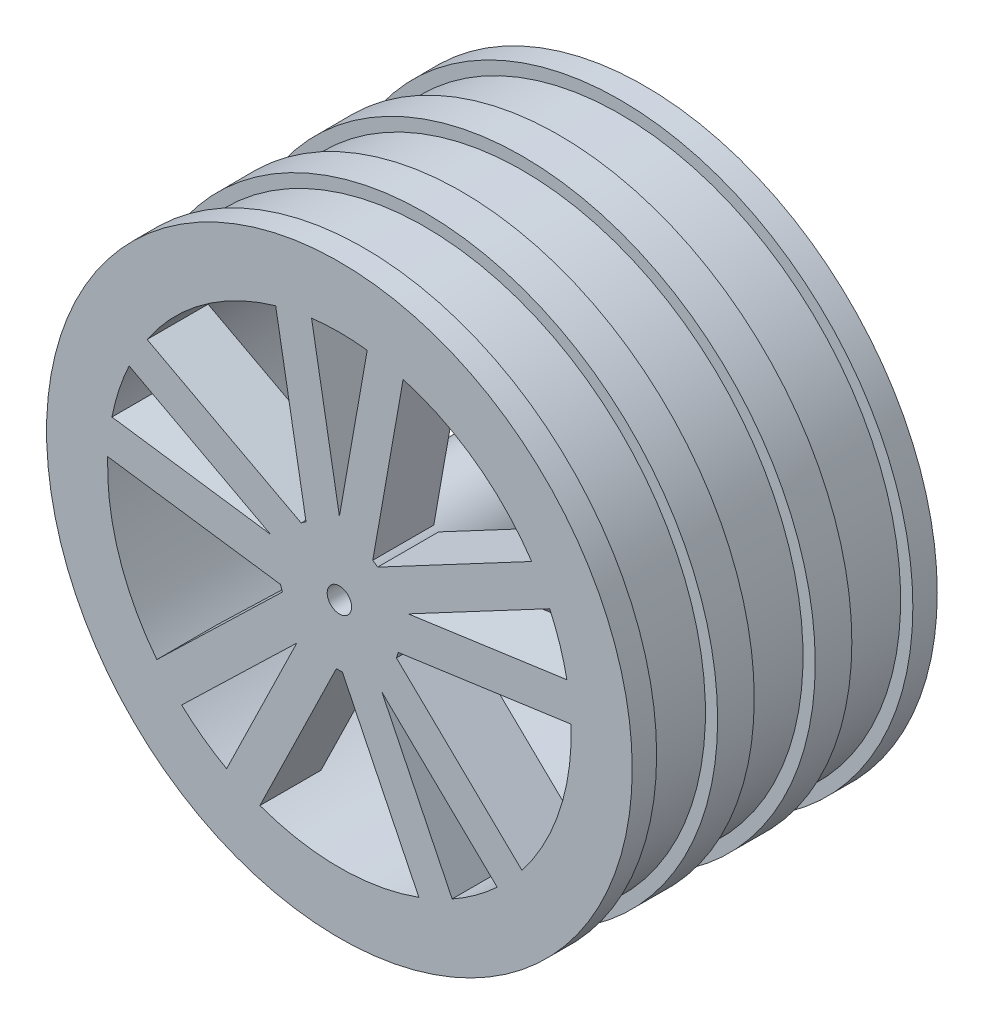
from build123d import *
from build123d.topology import SkipClean

# Parameters (mm, degrees)
SKETCH2_W            = 25
SKETCH2_H            = 5
BOSS_EXTRUDE1_DEPTH  = 5
CIRPATTERN1_COUNT    = 5
MIRROR1_COPY_1_DEPTH = 5
MIRROR1_COPY_2_DEPTH = 5
MIRROR1_COPY_3_DEPTH = 5
MIRROR1_COPY_4_DEPTH = 5
SKETCH4_R            = 5
BOSS_EXTRUDE2_DEPTH  = 25
SKETCH5_R            = 1
CUT_EXTRUDE1_DEPTH   = 43.154478
SKETCH6_W            = 5
SKETCH6_H            = 2


with BuildPart() as part:
    # Sketch2 → Revolve1 (revolve)
    with BuildSketch(Plane(origin=(0, 0, 0), x_dir=(0, 0, -1), z_dir=(1, 0, 0)), mode=Mode.PRIVATE) as revolve1_sk:
        with Locations((0, 21.5)):
            Rectangle(SKETCH2_W, SKETCH2_H)
    revolve(revolve1_sk.sketch.rotate(Axis((0, 0, 29.66813), (0, 0, -1)), 90), axis=Axis((0, 0, 29.66813), (0, 0, -1)))

    # Sketch3 → Boss-Extrude1 (add)
    with BuildSketch(Plane.XY.offset(12.5)):
        with BuildLine():
            Line((-6.093191, 23.213639), (-2, 0))
            Line((-2, 0), (0, 0))
            Line((0, 0), (0, 5.933748))
            Line((0, 5.933748), (-2.627489, 20.834978))
            ThreePointArc((-2.627489, 20.834978), (-1.316333, 20.958704), (0, 21))
            Line((0, 21), (0, 24))
            ThreePointArc((0, 24), (-3.071862, 23.802598), (-6.093191, 23.213639))
        make_face()
        with BuildLine():
            Line((0, 5.933748), (0, 0))
            Line((0, 0), (2, 0))
            Line((2, 0), (6.093191, 23.213639))
            ThreePointArc((6.093191, 23.213639), (3.071862, 23.802598), (0, 24))
            Line((0, 24), (0, 21))
            ThreePointArc((0, 21), (1.316333, 20.958704), (2.627489, 20.834978))
            Line((2.627489, 20.834978), (0, 5.933748))
        make_face()
    boss_extrude1 = extrude(amount=-BOSS_EXTRUDE1_DEPTH)

    # CirPattern1: Boss-Extrude1 ×5 about axis
    with SkipClean():  # the faces are left unmerged after this step: merging them gives an invalid solid
        cirpattern1_axis = Axis((0, 0, 0), (0, 0, 1))
        for i in range(1, CIRPATTERN1_COUNT):
            add(boss_extrude1.rotate(cirpattern1_axis, i * 360 / CIRPATTERN1_COUNT))

    # Mirror1: Boss-Extrude1 across plane
    with SkipClean():  # the faces are left unmerged after this step: merging them gives an invalid solid
        add(boss_extrude1.mirror(Plane.XY))

    # Mirror1 copy 1 sketch → Mirror1 copy 1 (add)
    with SkipClean():  # the faces are left unmerged after this step: merging them gives an invalid solid
        with BuildSketch(Plane(origin=(0, 0, -12.5), x_dir=(0.30901699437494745, 0.9510565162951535, 0), z_dir=(0, 0, -1))):
            with BuildLine():
                Line((-6.093191, -23.213639), (-2, 0))
                Line((-2, 0), (0, 0))
                Line((0, 0), (0, -5.933748))
                Line((0, -5.933748), (-2.627489, -20.834978))
                ThreePointArc((-2.627489, -20.834978), (-1.316333, -20.958704), (0, -21))
                Line((0, -21), (0, -24))
                ThreePointArc((0, -24), (-3.071862, -23.802598), (-6.093191, -23.213639))
            make_face()
            with BuildLine():
                Line((0, -5.933748), (0, 0))
                Line((0, 0), (2, 0))
                Line((2, 0), (6.093191, -23.213639))
                ThreePointArc((6.093191, -23.213639), (3.071862, -23.802598), (0, -24))
                Line((0, -24), (0, -21))
                ThreePointArc((0, -21), (1.316333, -20.958704), (2.627489, -20.834978))
                Line((2.627489, -20.834978), (0, -5.933748))
            make_face()
        extrude(amount=-MIRROR1_COPY_1_DEPTH)

    # Mirror1 copy 2 sketch → Mirror1 copy 2 (add)
    with SkipClean():  # the faces are left unmerged after this step: merging them gives an invalid solid
        with BuildSketch(Plane(origin=(0, 0, -12.5), x_dir=(-0.8090169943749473, 0.5877852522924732, 0), z_dir=(0, 0, -1))):
            with BuildLine():
                Line((-6.093191, -23.213639), (-2, 0))
                Line((-2, 0), (0, 0))
                Line((0, 0), (0, -5.933748))
                Line((0, -5.933748), (-2.627489, -20.834978))
                ThreePointArc((-2.627489, -20.834978), (-1.316333, -20.958704), (0, -21))
                Line((0, -21), (0, -24))
                ThreePointArc((0, -24), (-3.071862, -23.802598), (-6.093191, -23.213639))
            make_face()
            with BuildLine():
                Line((0, -5.933748), (0, 0))
                Line((0, 0), (2, 0))
                Line((2, 0), (6.093191, -23.213639))
                ThreePointArc((6.093191, -23.213639), (3.071862, -23.802598), (0, -24))
                Line((0, -24), (0, -21))
                ThreePointArc((0, -21), (1.316333, -20.958704), (2.627489, -20.834978))
                Line((2.627489, -20.834978), (0, -5.933748))
            make_face()
        extrude(amount=-MIRROR1_COPY_2_DEPTH)

    # Mirror1 copy 3 sketch → Mirror1 copy 3 (add)
    with SkipClean():  # the faces are left unmerged after this step: merging them gives an invalid solid
        with BuildSketch(Plane(origin=(0, 0, -12.5), x_dir=(-0.8090169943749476, -0.587785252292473, 0), z_dir=(0, 0, -1))):
            with BuildLine():
                Line((-6.093191, -23.213639), (-2, 0))
                Line((-2, 0), (0, 0))
                Line((0, 0), (0, -5.933748))
                Line((0, -5.933748), (-2.627489, -20.834978))
                ThreePointArc((-2.627489, -20.834978), (-1.316333, -20.958704), (0, -21))
                Line((0, -21), (0, -24))
                ThreePointArc((0, -24), (-3.071862, -23.802598), (-6.093191, -23.213639))
            make_face()
            with BuildLine():
                Line((0, -5.933748), (0, 0))
                Line((0, 0), (2, 0))
                Line((2, 0), (6.093191, -23.213639))
                ThreePointArc((6.093191, -23.213639), (3.071862, -23.802598), (0, -24))
                Line((0, -24), (0, -21))
                ThreePointArc((0, -21), (1.316333, -20.958704), (2.627489, -20.834978))
                Line((2.627489, -20.834978), (0, -5.933748))
            make_face()
        extrude(amount=-MIRROR1_COPY_3_DEPTH)

    # Mirror1 copy 4 sketch → Mirror1 copy 4 (add)
    with SkipClean():  # the faces are left unmerged after this step: merging them gives an invalid solid
        with BuildSketch(Plane(origin=(0, 0, -12.5), x_dir=(0.30901699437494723, -0.9510565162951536, 0), z_dir=(0, 0, -1))):
            with BuildLine():
                Line((-6.093191, -23.213639), (-2, 0))
                Line((-2, 0), (0, 0))
                Line((0, 0), (0, -5.933748))
                Line((0, -5.933748), (-2.627489, -20.834978))
                ThreePointArc((-2.627489, -20.834978), (-1.316333, -20.958704), (0, -21))
                Line((0, -21), (0, -24))
                ThreePointArc((0, -24), (-3.071862, -23.802598), (-6.093191, -23.213639))
            make_face()
            with BuildLine():
                Line((0, -5.933748), (0, 0))
                Line((0, 0), (2, 0))
                Line((2, 0), (6.093191, -23.213639))
                ThreePointArc((6.093191, -23.213639), (3.071862, -23.802598), (0, -24))
                Line((0, -24), (0, -21))
                ThreePointArc((0, -21), (1.316333, -20.958704), (2.627489, -20.834978))
                Line((2.627489, -20.834978), (0, -5.933748))
            make_face()
        extrude(amount=-MIRROR1_COPY_4_DEPTH)

    # Sketch4 → Boss-Extrude2 (add)
    with BuildSketch(Plane.XY.offset(12.5)):
        with Locations(Location((0, 0, 0), (0, 0, 344.801172))):
            Circle(SKETCH4_R)
    extrude(amount=-BOSS_EXTRUDE2_DEPTH)

    # Sketch5 → Cut-Extrude1 (cut, through all)
    with BuildSketch(Plane.XY.offset(12.5)):
        Circle(SKETCH5_R)
    extrude(amount=-CUT_EXTRUDE1_DEPTH, mode=Mode.SUBTRACT)

    # Sketch6 → Cut-Revolve1 (revolve, cut)
    with BuildSketch(Plane(origin=(0, 0, 0), x_dir=(0, 0, -1), z_dir=(1, 0, 0)), mode=Mode.PRIVATE) as cut_revolve1_sk:
        with Locations((-8, 24)):
            Rectangle(SKETCH6_W, SKETCH6_H)
        with Locations((0, 24)):
            Rectangle(SKETCH6_W, SKETCH6_H)
        with Locations((8, 24)):
            Rectangle(SKETCH6_W, SKETCH6_H)
    revolve(cut_revolve1_sk.sketch.rotate(Axis((0, 0, -62.62309), (0, 0, 1)), 270), axis=Axis((0, 0, -62.62309), (0, 0, 1)), mode=Mode.SUBTRACT)


solid = part.part
